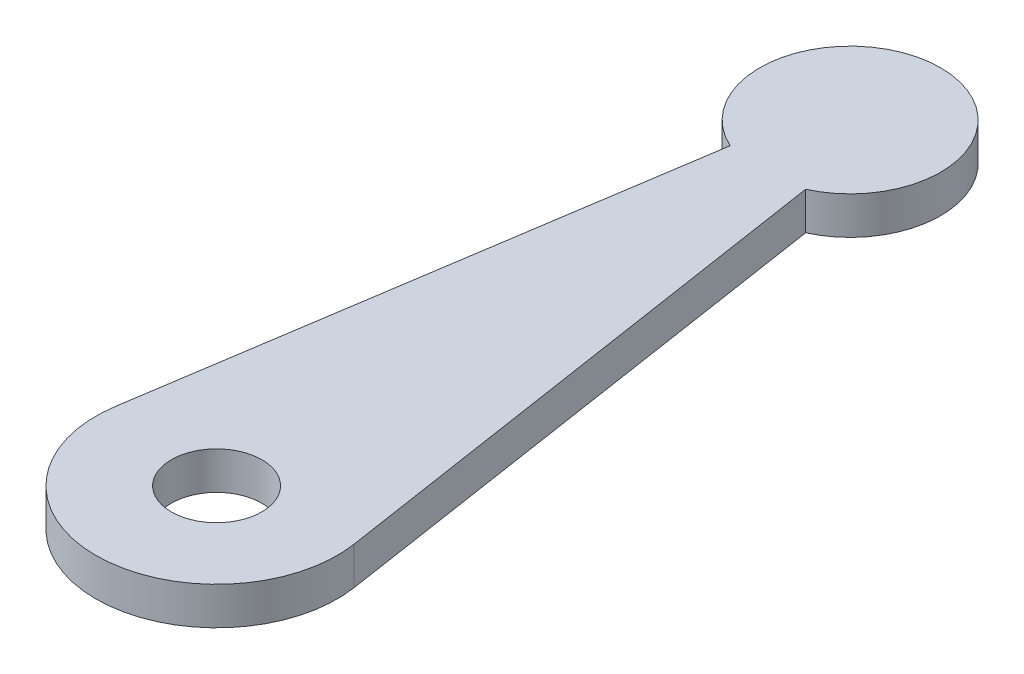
ISO-10303-21;
HEADER;
FILE_DESCRIPTION(('STEP AP214'),'2;1');
FILE_NAME('part.step','',(''),(''),'','','');
FILE_SCHEMA(('AUTOMOTIVE_DESIGN { 1 0 10303 214 1 1 1 1 }'));
ENDSEC;
DATA;
#1=APPLICATION_CONTEXT('core data for automotive mechanical design processes');
#2=APPLICATION_PROTOCOL_DEFINITION('international standard','automotive_design',2000,#1);
#3=PRODUCT_CONTEXT('',#1,'mechanical');
#4=PRODUCT('Part','Part','',(#3));
#5=PRODUCT_RELATED_PRODUCT_CATEGORY('part','',(#4));
#6=PRODUCT_DEFINITION_FORMATION('','',#4);
#7=PRODUCT_DEFINITION_CONTEXT('part definition',#1,'design');
#8=PRODUCT_DEFINITION('design','',#6,#7);
#9=PRODUCT_DEFINITION_SHAPE('','',#8);
#10=(LENGTH_UNIT() NAMED_UNIT(*) SI_UNIT(.MILLI.,.METRE.));
#11=(NAMED_UNIT(*) PLANE_ANGLE_UNIT() SI_UNIT($,.RADIAN.));
#12=(NAMED_UNIT(*) SI_UNIT($,.STERADIAN.) SOLID_ANGLE_UNIT());
#13=UNCERTAINTY_MEASURE_WITH_UNIT(LENGTH_MEASURE(1.E-05),#10,'distance_accuracy_value','');
#14=(GEOMETRIC_REPRESENTATION_CONTEXT(3) GLOBAL_UNCERTAINTY_ASSIGNED_CONTEXT((#13)) GLOBAL_UNIT_ASSIGNED_CONTEXT((#10,
#11,#12)) REPRESENTATION_CONTEXT('',''));
#15=CARTESIAN_POINT('',(0.,0.,0.));
#16=DIRECTION('',(0.,0.,1.));
#17=DIRECTION('',(1.,0.,0.));
#18=AXIS2_PLACEMENT_3D('',#15,#16,#17);
#19=CARTESIAN_POINT('',(-0.000130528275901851,2.5,-41.9998303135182));
#20=DIRECTION('',(0.,1.,0.));
#21=DIRECTION('',(0.,0.,1.));
#22=AXIS2_PLACEMENT_3D('',#19,#20,#21);
#23=PLANE('',#22);
#24=CARTESIAN_POINT('',(-0.000130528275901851,2.5,-41.9998303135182));
#25=DIRECTION('',(0.,1.,0.));
#26=DIRECTION('',(0.,0.,1.));
#27=AXIS2_PLACEMENT_3D('',#24,#25,#26);
#28=CIRCLE('',#27,6.);
#29=CARTESIAN_POINT('',(2.5004905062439,2.5,-36.5457589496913));
#30=VERTEX_POINT('',#29);
#31=CARTESIAN_POINT('',(-2.5007515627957,2.5,-36.5457589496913));
#32=VERTEX_POINT('',#31);
#33=EDGE_CURVE('E99',#30,#32,#28,.T.);
#34=ORIENTED_EDGE('',*,*,#33,.T.);
#35=DIRECTION('',(-0.151263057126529,0.,0.988493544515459));
#36=VECTOR('',#35,1.);
#37=CARTESIAN_POINT('',(-2.5007515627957,2.5,-36.5457589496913));
#38=LINE('',#37,#36);
#39=CARTESIAN_POINT('',(-7.90794835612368,2.5,-1.21010445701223));
#40=VERTEX_POINT('',#39);
#41=EDGE_CURVE('E84',#32,#40,#38,.T.);
#42=ORIENTED_EDGE('',*,*,#41,.T.);
#43=CARTESIAN_POINT('',(0.,2.5,0.));
#44=DIRECTION('',(0.,1.,0.));
#45=DIRECTION('',(0.,0.,1.));
#46=AXIS2_PLACEMENT_3D('',#43,#44,#45);
#47=CIRCLE('',#46,8.);
#48=CARTESIAN_POINT('',(7.90794835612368,2.5,-1.21010445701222));
#49=VERTEX_POINT('',#48);
#50=EDGE_CURVE('E50',#40,#49,#47,.T.);
#51=ORIENTED_EDGE('',*,*,#50,.T.);
#52=DIRECTION('',(-0.151270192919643,0.,-0.988492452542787));
#53=VECTOR('',#52,1.);
#54=CARTESIAN_POINT('',(2.5004905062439,2.5,-36.5457589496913));
#55=LINE('',#54,#53);
#56=EDGE_CURVE('E45',#49,#30,#55,.T.);
#57=ORIENTED_EDGE('',*,*,#56,.T.);
#58=EDGE_LOOP('',(#34,#42,#51,#57));
#59=FACE_BOUND('',#58,.T.);
#60=CARTESIAN_POINT('',(0.,2.5,0.));
#61=DIRECTION('',(0.,1.,0.));
#62=DIRECTION('',(0.,0.,1.));
#63=AXIS2_PLACEMENT_3D('',#60,#61,#62);
#64=CIRCLE('',#63,3.);
#65=CARTESIAN_POINT('',(0.,2.5,3.));
#66=VERTEX_POINT('',#65);
#67=EDGE_CURVE('E89',#66,#66,#64,.T.);
#68=ORIENTED_EDGE('',*,*,#67,.F.);
#69=EDGE_LOOP('',(#68));
#70=FACE_BOUND('',#69,.T.);
#71=ADVANCED_FACE('F30',(#59,#70),#23,.T.);
#72=CARTESIAN_POINT('',(-0.000130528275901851,0.,-41.9998303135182));
#73=DIRECTION('',(0.,1.,0.));
#74=DIRECTION('',(0.,0.,1.));
#75=AXIS2_PLACEMENT_3D('',#72,#73,#74);
#76=PLANE('',#75);
#77=CARTESIAN_POINT('',(-0.000130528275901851,0.,-41.9998303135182));
#78=DIRECTION('',(0.,1.,0.));
#79=DIRECTION('',(0.,0.,1.));
#80=AXIS2_PLACEMENT_3D('',#77,#78,#79);
#81=CIRCLE('',#80,6.);
#82=CARTESIAN_POINT('',(2.5004905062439,0.,-36.5457589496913));
#83=VERTEX_POINT('',#82);
#84=CARTESIAN_POINT('',(-2.5007515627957,0.,-36.5457589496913));
#85=VERTEX_POINT('',#84);
#86=EDGE_CURVE('E76',#83,#85,#81,.T.);
#87=ORIENTED_EDGE('',*,*,#86,.F.);
#88=DIRECTION('',(-0.151270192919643,0.,-0.988492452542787));
#89=VECTOR('',#88,1.);
#90=CARTESIAN_POINT('',(2.5004905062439,0.,-36.5457589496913));
#91=LINE('',#90,#89);
#92=CARTESIAN_POINT('',(7.90794835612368,0.,-1.21010445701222));
#93=VERTEX_POINT('',#92);
#94=EDGE_CURVE('E97',#93,#83,#91,.T.);
#95=ORIENTED_EDGE('',*,*,#94,.F.);
#96=CARTESIAN_POINT('',(0.,0.,0.));
#97=DIRECTION('',(0.,1.,0.));
#98=DIRECTION('',(0.,0.,1.));
#99=AXIS2_PLACEMENT_3D('',#96,#97,#98);
#100=CIRCLE('',#99,8.);
#101=CARTESIAN_POINT('',(-7.90794835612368,0.,-1.21010445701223));
#102=VERTEX_POINT('',#101);
#103=EDGE_CURVE('E77',#102,#93,#100,.T.);
#104=ORIENTED_EDGE('',*,*,#103,.F.);
#105=DIRECTION('',(-0.151263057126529,0.,0.988493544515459));
#106=VECTOR('',#105,1.);
#107=CARTESIAN_POINT('',(-2.5007515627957,0.,-36.5457589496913));
#108=LINE('',#107,#106);
#109=EDGE_CURVE('E71',#85,#102,#108,.T.);
#110=ORIENTED_EDGE('',*,*,#109,.F.);
#111=EDGE_LOOP('',(#87,#95,#104,#110));
#112=FACE_BOUND('',#111,.T.);
#113=CARTESIAN_POINT('',(0.,0.,0.));
#114=DIRECTION('',(0.,1.,0.));
#115=DIRECTION('',(0.,0.,1.));
#116=AXIS2_PLACEMENT_3D('',#113,#114,#115);
#117=CIRCLE('',#116,3.);
#118=CARTESIAN_POINT('',(0.,0.,3.));
#119=VERTEX_POINT('',#118);
#120=EDGE_CURVE('E92',#119,#119,#117,.T.);
#121=ORIENTED_EDGE('',*,*,#120,.T.);
#122=EDGE_LOOP('',(#121));
#123=FACE_BOUND('',#122,.T.);
#124=ADVANCED_FACE('F72',(#112,#123),#76,.F.);
#125=CARTESIAN_POINT('',(-0.000130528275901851,2.5,-41.9998303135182));
#126=DIRECTION('',(0.,-1.,0.));
#127=DIRECTION('',(0.,0.,-1.));
#128=AXIS2_PLACEMENT_3D('',#125,#126,#127);
#129=CYLINDRICAL_SURFACE('',#128,6.);
#130=ORIENTED_EDGE('',*,*,#86,.T.);
#131=DIRECTION('',(0.,-1.,0.));
#132=VECTOR('',#131,1.);
#133=CARTESIAN_POINT('',(-2.5007515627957,2.5,-36.5457589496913));
#134=LINE('',#133,#132);
#135=EDGE_CURVE('E11',#32,#85,#134,.T.);
#136=ORIENTED_EDGE('',*,*,#135,.F.);
#137=ORIENTED_EDGE('',*,*,#33,.F.);
#138=DIRECTION('',(0.,-1.,0.));
#139=VECTOR('',#138,1.);
#140=CARTESIAN_POINT('',(2.5004905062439,2.5,-36.5457589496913));
#141=LINE('',#140,#139);
#142=EDGE_CURVE('E88',#30,#83,#141,.T.);
#143=ORIENTED_EDGE('',*,*,#142,.T.);
#144=EDGE_LOOP('',(#130,#136,#137,#143));
#145=FACE_BOUND('',#144,.T.);
#146=ADVANCED_FACE('F32',(#145),#129,.T.);
#147=CARTESIAN_POINT('',(-2.5007515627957,2.5,-36.5457589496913));
#148=DIRECTION('',(0.988493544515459,0.,0.151263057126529));
#149=DIRECTION('',(0.151263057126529,0.,-0.988493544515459));
#150=AXIS2_PLACEMENT_3D('',#147,#148,#149);
#151=PLANE('',#150);
#152=ORIENTED_EDGE('',*,*,#109,.T.);
#153=DIRECTION('',(0.,-1.,0.));
#154=VECTOR('',#153,1.);
#155=CARTESIAN_POINT('',(-7.90794835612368,2.5,-1.21010445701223));
#156=LINE('',#155,#154);
#157=EDGE_CURVE('E38',#40,#102,#156,.T.);
#158=ORIENTED_EDGE('',*,*,#157,.F.);
#159=ORIENTED_EDGE('',*,*,#41,.F.);
#160=ORIENTED_EDGE('',*,*,#135,.T.);
#161=EDGE_LOOP('',(#152,#158,#159,#160));
#162=FACE_BOUND('',#161,.T.);
#163=ADVANCED_FACE('F83',(#162),#151,.F.);
#164=CARTESIAN_POINT('',(0.,2.5,0.));
#165=DIRECTION('',(0.,-1.,0.));
#166=DIRECTION('',(0.,0.,-1.));
#167=AXIS2_PLACEMENT_3D('',#164,#165,#166);
#168=CYLINDRICAL_SURFACE('',#167,8.);
#169=ORIENTED_EDGE('',*,*,#103,.T.);
#170=DIRECTION('',(0.,-1.,0.));
#171=VECTOR('',#170,1.);
#172=CARTESIAN_POINT('',(7.90794835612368,2.5,-1.21010445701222));
#173=LINE('',#172,#171);
#174=EDGE_CURVE('E105',#49,#93,#173,.T.);
#175=ORIENTED_EDGE('',*,*,#174,.F.);
#176=ORIENTED_EDGE('',*,*,#50,.F.);
#177=ORIENTED_EDGE('',*,*,#157,.T.);
#178=EDGE_LOOP('',(#169,#175,#176,#177));
#179=FACE_BOUND('',#178,.T.);
#180=ADVANCED_FACE('F108',(#179),#168,.T.);
#181=CARTESIAN_POINT('',(2.5004905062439,2.5,-36.5457589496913));
#182=DIRECTION('',(-0.988492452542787,0.,0.151270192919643));
#183=DIRECTION('',(0.151270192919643,0.,0.988492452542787));
#184=AXIS2_PLACEMENT_3D('',#181,#182,#183);
#185=PLANE('',#184);
#186=ORIENTED_EDGE('',*,*,#94,.T.);
#187=ORIENTED_EDGE('',*,*,#142,.F.);
#188=ORIENTED_EDGE('',*,*,#56,.F.);
#189=ORIENTED_EDGE('',*,*,#174,.T.);
#190=EDGE_LOOP('',(#186,#187,#188,#189));
#191=FACE_BOUND('',#190,.T.);
#192=ADVANCED_FACE('F110',(#191),#185,.F.);
#193=CARTESIAN_POINT('',(0.,2.5,0.));
#194=DIRECTION('',(0.,-1.,0.));
#195=DIRECTION('',(0.,0.,-1.));
#196=AXIS2_PLACEMENT_3D('',#193,#194,#195);
#197=CYLINDRICAL_SURFACE('',#196,3.);
#198=ORIENTED_EDGE('',*,*,#67,.T.);
#199=EDGE_LOOP('',(#198));
#200=FACE_BOUND('',#199,.T.);
#201=ORIENTED_EDGE('',*,*,#120,.F.);
#202=EDGE_LOOP('',(#201));
#203=FACE_BOUND('',#202,.T.);
#204=ADVANCED_FACE('F116',(#200,#203),#197,.F.);
#205=CLOSED_SHELL('',(#71,#124,#146,#163,#180,#192,#204));
#206=MANIFOLD_SOLID_BREP('B2',#205);
#207=ADVANCED_BREP_SHAPE_REPRESENTATION('',(#18,#206),#14);
#208=SHAPE_DEFINITION_REPRESENTATION(#9,#207);
ENDSEC;
END-ISO-10303-21;
